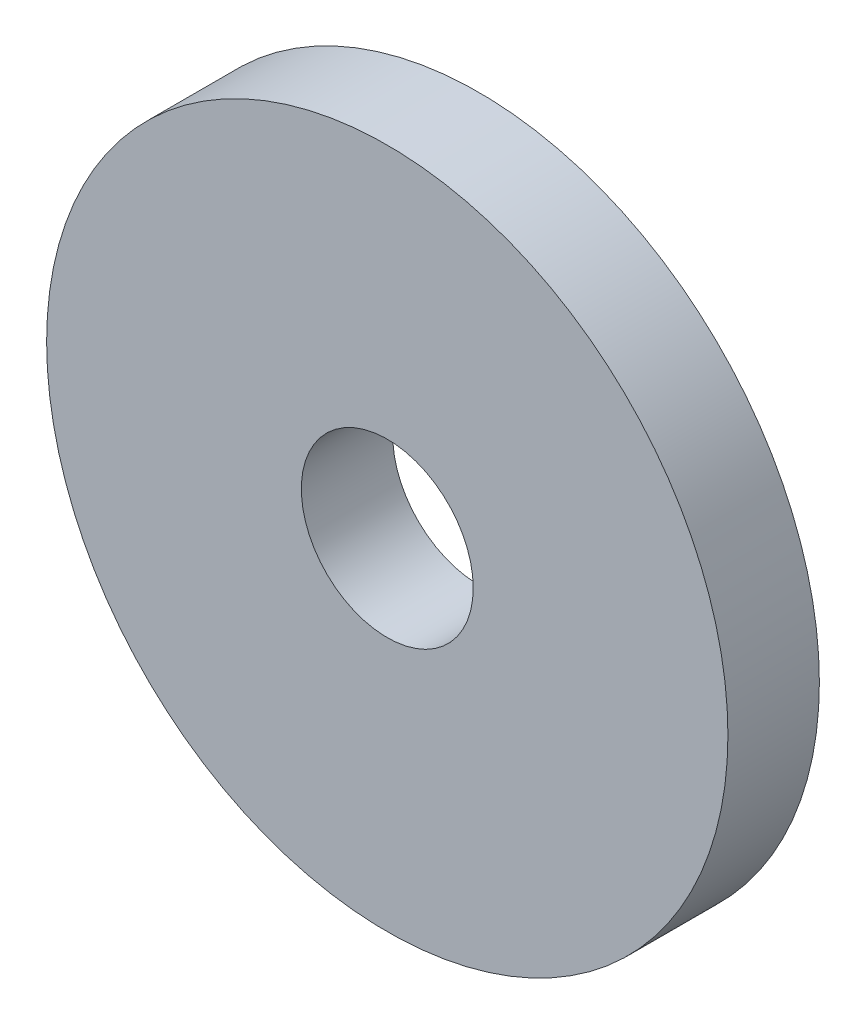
from build123d import *

# Parameters (mm, degrees)
SKETCH1_R      = 9.4615
SKETCH1_R_2    = 2.3876
EXTRUDE1_DEPTH = 2.54


with BuildPart() as part:
    # Sketch1 → Extrude1 (new body)
    with BuildSketch(Plane.XY):
        Circle(SKETCH1_R)
        Circle(SKETCH1_R_2, mode=Mode.SUBTRACT)
    extrude(amount=EXTRUDE1_DEPTH)


solid = part.part
